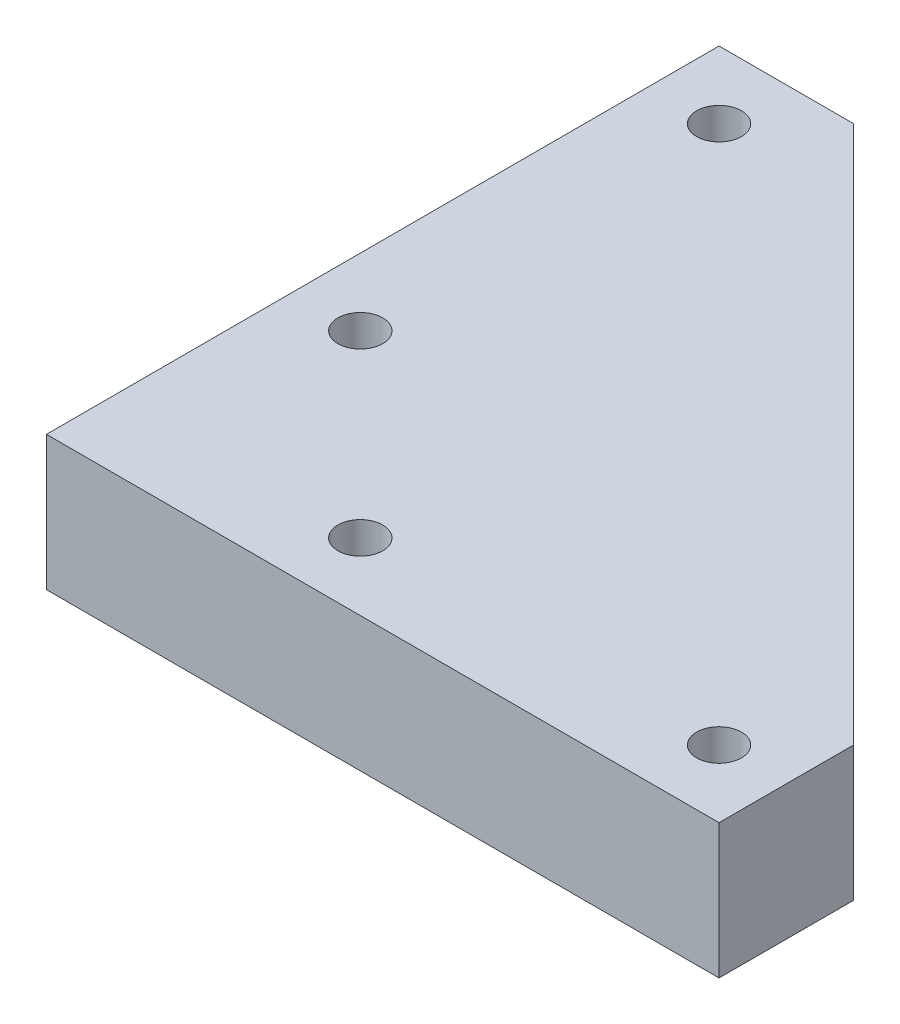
from build123d import *

# Parameters (mm, degrees)
SKETCH1_W                   = 95.25
SKETCH1_H                   = 95.25
BOSS_EXTRUDE1_DEPTH         = 19.05
CUT_EXTRUDE1_DEPTH          = 19.05
F_1_4_0_25_DIAMETER_HOLE1_D = 6.35
F_1_4_0_25_DIAMETER_HOLE2_D = 6.35
F_1_4_0_25_DIAMETER_HOLE3_D = 6.35
F_1_4_0_25_DIAMETER_HOLE4_D = 6.35


with BuildPart() as part:
    # Sketch1 → Boss-Extrude1 (new body)
    with BuildSketch(Plane(origin=(0, 0, 0), x_dir=(1, 0, 0), z_dir=(0, 1, 0))):
        with Locations((47.625, -47.625)):
            Rectangle(SKETCH1_W, SKETCH1_H)
    extrude(amount=BOSS_EXTRUDE1_DEPTH)

    # Sketch2 → Cut-Extrude1 (cut)
    with BuildSketch(Plane(origin=(0, 19.05, 0), x_dir=(1, 0, 0), z_dir=(0, 1, 0))):
        Polygon((19.05, 0), (95.25, -76.2), (162.085045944, -9.364954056), (85.885045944, 66.835045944), align=None)
    extrude(amount=-CUT_EXTRUDE1_DEPTH, mode=Mode.SUBTRACT)

    # 1_4 _0.25_ Diameter Hole1 (through all)
    with Locations(Plane(origin=(0, 19.05, 0), x_dir=(1, 0, 0), z_dir=(0, 1, 0))):
        with Locations((9.525, -9.525)):
            Hole(F_1_4_0_25_DIAMETER_HOLE1_D / 2)

    # 1_4 _0.25_ Diameter Hole2 (through all)
    with Locations(Plane(origin=(0, 19.05, 0), x_dir=(1, 0, 0), z_dir=(0, 1, 0))):
        with Locations((85.725, -85.725)):
            Hole(F_1_4_0_25_DIAMETER_HOLE2_D / 2)

    # 1_4 _0.25_ Diameter Hole3 (through all)
    with Locations(Plane(origin=(0, 19.05, 0), x_dir=(1, 0, 0), z_dir=(0, 1, 0))):
        with Locations((9.525, -60.325)):
            Hole(F_1_4_0_25_DIAMETER_HOLE3_D / 2)

    # 1_4 _0.25_ Diameter Hole4 (through all)
    with Locations(Plane(origin=(0, 19.05, 0), x_dir=(1, 0, 0), z_dir=(0, 1, 0))):
        with Locations((34.925, -85.725)):
            Hole(F_1_4_0_25_DIAMETER_HOLE4_D / 2)


solid = part.part
